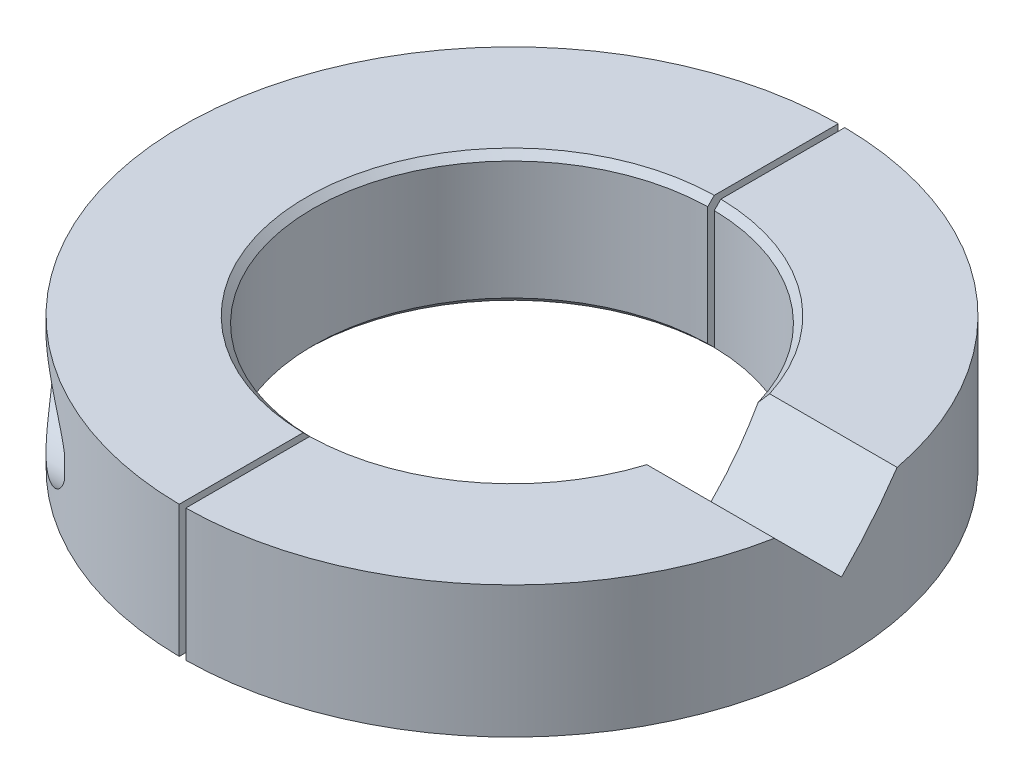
ISO-10303-21;
HEADER;
FILE_DESCRIPTION(('STEP AP214'),'2;1');
FILE_NAME('part.step','',(''),(''),'','','');
FILE_SCHEMA(('AUTOMOTIVE_DESIGN { 1 0 10303 214 1 1 1 1 }'));
ENDSEC;
DATA;
#1=APPLICATION_CONTEXT('core data for automotive mechanical design processes');
#2=APPLICATION_PROTOCOL_DEFINITION('international standard','automotive_design',2000,#1);
#3=PRODUCT_CONTEXT('',#1,'mechanical');
#4=PRODUCT('Part','Part','',(#3));
#5=PRODUCT_RELATED_PRODUCT_CATEGORY('part','',(#4));
#6=PRODUCT_DEFINITION_FORMATION('','',#4);
#7=PRODUCT_DEFINITION_CONTEXT('part definition',#1,'design');
#8=PRODUCT_DEFINITION('design','',#6,#7);
#9=PRODUCT_DEFINITION_SHAPE('','',#8);
#10=(LENGTH_UNIT() NAMED_UNIT(*) SI_UNIT(.MILLI.,.METRE.));
#11=(NAMED_UNIT(*) PLANE_ANGLE_UNIT() SI_UNIT($,.RADIAN.));
#12=(NAMED_UNIT(*) SI_UNIT($,.STERADIAN.) SOLID_ANGLE_UNIT());
#13=UNCERTAINTY_MEASURE_WITH_UNIT(LENGTH_MEASURE(1.E-05),#10,'distance_accuracy_value','');
#14=(GEOMETRIC_REPRESENTATION_CONTEXT(3) GLOBAL_UNCERTAINTY_ASSIGNED_CONTEXT((#13)) GLOBAL_UNIT_ASSIGNED_CONTEXT((#10,
#11,#12)) REPRESENTATION_CONTEXT('',''));
#15=CARTESIAN_POINT('',(0.,0.,0.));
#16=DIRECTION('',(0.,0.,1.));
#17=DIRECTION('',(1.,0.,0.));
#18=AXIS2_PLACEMENT_3D('',#15,#16,#17);
#19=CARTESIAN_POINT('',(0.,5.,0.));
#20=DIRECTION('',(0.,1.,0.));
#21=DIRECTION('',(0.,0.,1.));
#22=AXIS2_PLACEMENT_3D('',#19,#20,#21);
#23=PLANE('',#22);
#24=DIRECTION('',(0.,0.,-1.));
#25=VECTOR('',#24,1.);
#26=CARTESIAN_POINT('',(-0.249999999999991,5.,-36.6435199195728));
#27=LINE('',#26,#25);
#28=CARTESIAN_POINT('',(-0.249999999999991,5.,15.5979966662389));
#29=VERTEX_POINT('',#28);
#30=CARTESIAN_POINT('',(-0.249999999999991,5.,24.9987499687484));
#31=VERTEX_POINT('',#30);
#32=EDGE_CURVE('E132',#29,#31,#27,.F.);
#33=ORIENTED_EDGE('',*,*,#32,.F.);
#34=CARTESIAN_POINT('',(0.,5.,0.));
#35=DIRECTION('',(0.,1.,0.));
#36=DIRECTION('',(0.,0.,1.));
#37=AXIS2_PLACEMENT_3D('',#34,#35,#36);
#38=CIRCLE('',#37,15.6);
#39=CARTESIAN_POINT('',(-0.249999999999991,5.,-15.5979966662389));
#40=VERTEX_POINT('',#39);
#41=EDGE_CURVE('E13',#29,#40,#38,.F.);
#42=ORIENTED_EDGE('',*,*,#41,.T.);
#43=CARTESIAN_POINT('',(-0.249999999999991,5.,-24.9987499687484));
#44=VERTEX_POINT('',#43);
#45=EDGE_CURVE('E237',#44,#40,#27,.F.);
#46=ORIENTED_EDGE('',*,*,#45,.F.);
#47=CARTESIAN_POINT('',(0.,5.,0.));
#48=DIRECTION('',(0.,1.,0.));
#49=DIRECTION('',(0.,0.,1.));
#50=AXIS2_PLACEMENT_3D('',#47,#48,#49);
#51=CIRCLE('',#50,25.);
#52=EDGE_CURVE('E145',#44,#31,#51,.T.);
#53=ORIENTED_EDGE('',*,*,#52,.T.);
#54=EDGE_LOOP('',(#33,#42,#46,#53));
#55=FACE_BOUND('',#54,.T.);
#56=ADVANCED_FACE('F48',(#55),#23,.T.);
#57=CARTESIAN_POINT('',(0.,5.,0.));
#58=DIRECTION('',(0.,-1.,0.));
#59=DIRECTION('',(0.,0.,-1.));
#60=AXIS2_PLACEMENT_3D('',#57,#58,#59);
#61=CYLINDRICAL_SURFACE('',#60,25.);
#62=DIRECTION('',(0.,-1.,0.));
#63=VECTOR('',#62,1.);
#64=CARTESIAN_POINT('',(-12.,5.,21.9317121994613));
#65=LINE('',#64,#63);
#66=CARTESIAN_POINT('',(-12.,0.735961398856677,21.9317121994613));
#67=VERTEX_POINT('',#66);
#68=CARTESIAN_POINT('',(-12.,-0.735961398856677,21.9317121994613));
#69=VERTEX_POINT('',#68);
#70=EDGE_CURVE('E210',#67,#69,#65,.T.);
#71=ORIENTED_EDGE('',*,*,#70,.T.);
#72=CARTESIAN_POINT('',(-12.,-0.735961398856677,21.9317121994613));
#73=CARTESIAN_POINT('',(-12.0283083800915,-0.818707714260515,21.9162231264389));
#74=CARTESIAN_POINT('',(-12.060731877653,-0.899430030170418,21.8984113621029));
#75=CARTESIAN_POINT('',(-12.1323680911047,-1.05648581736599,21.8588042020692));
#76=CARTESIAN_POINT('',(-12.1715593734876,-1.1328321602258,21.8370213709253));
#77=CARTESIAN_POINT('',(-12.2962658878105,-1.35346526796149,21.7671942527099));
#78=CARTESIAN_POINT('',(-12.3897833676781,-1.49166650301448,21.7142024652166));
#79=CARTESIAN_POINT('',(-12.5702419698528,-1.72625326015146,21.610128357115));
#80=CARTESIAN_POINT('',(-12.6546995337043,-1.82544814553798,21.5608201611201));
#81=CARTESIAN_POINT('',(-12.8299642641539,-2.01517076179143,21.4569890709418));
#82=CARTESIAN_POINT('',(-12.9207736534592,-2.10569543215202,21.4024643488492));
#83=CARTESIAN_POINT('',(-13.1077432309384,-2.27965864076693,21.2884750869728));
#84=CARTESIAN_POINT('',(-13.2039436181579,-2.36302747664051,21.2289711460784));
#85=CARTESIAN_POINT('',(-13.3997213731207,-2.52254872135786,21.105943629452));
#86=CARTESIAN_POINT('',(-13.4992998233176,-2.59869878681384,21.0424187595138));
#87=CARTESIAN_POINT('',(-13.7723281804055,-2.79597420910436,20.8654024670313));
#88=CARTESIAN_POINT('',(-13.9481243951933,-2.91073372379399,20.7484010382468));
#89=CARTESIAN_POINT('',(-14.3037024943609,-3.12274791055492,20.5048931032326));
#90=CARTESIAN_POINT('',(-14.4834867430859,-3.21999186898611,20.3783808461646));
#91=CARTESIAN_POINT('',(-14.8447089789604,-3.39768543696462,20.1167662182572));
#92=CARTESIAN_POINT('',(-15.026144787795,-3.47815454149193,19.9816740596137));
#93=CARTESIAN_POINT('',(-15.3892718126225,-3.62258324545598,19.7033663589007));
#94=CARTESIAN_POINT('',(-15.5709629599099,-3.68654665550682,19.5601527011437));
#95=CARTESIAN_POINT('',(-15.9396067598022,-3.79950500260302,19.2610278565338));
#96=CARTESIAN_POINT('',(-16.1265247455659,-3.84790757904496,19.1048490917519));
#97=CARTESIAN_POINT('',(-16.4979985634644,-3.92566815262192,18.7849975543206));
#98=CARTESIAN_POINT('',(-16.6825538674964,-3.95502196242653,18.6213231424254));
#99=CARTESIAN_POINT('',(-17.0476057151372,-3.99316452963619,18.2877046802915));
#100=CARTESIAN_POINT('',(-17.2281084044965,-4.00198685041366,18.1177713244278));
#101=CARTESIAN_POINT('',(-17.583737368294,-3.99726513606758,17.7728318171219));
#102=CARTESIAN_POINT('',(-17.758866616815,-3.98373370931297,17.5978285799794));
#103=CARTESIAN_POINT('',(-18.1546593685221,-3.92415547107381,17.1904479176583));
#104=CARTESIAN_POINT('',(-18.3728972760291,-3.86944147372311,16.9568688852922));
#105=CARTESIAN_POINT('',(-18.7925142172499,-3.71241252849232,16.4905852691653));
#106=CARTESIAN_POINT('',(-18.9939164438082,-3.61016438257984,16.2578799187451));
#107=CARTESIAN_POINT('',(-19.3360434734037,-3.37855463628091,15.8484676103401));
#108=CARTESIAN_POINT('',(-19.4808573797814,-3.2586723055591,15.6698510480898));
#109=CARTESIAN_POINT('',(-19.7521196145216,-2.9833990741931,15.3264957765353));
#110=CARTESIAN_POINT('',(-19.8785878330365,-2.82804710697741,15.1617421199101));
#111=CARTESIAN_POINT('',(-20.0898923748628,-2.51083820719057,14.8802543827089));
#112=CARTESIAN_POINT('',(-20.17815454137,-2.3543560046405,14.7600906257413));
#113=CARTESIAN_POINT('',(-20.2969169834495,-2.10286578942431,14.5958813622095));
#114=CARTESIAN_POINT('',(-20.3342454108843,-2.01620150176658,14.5437992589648));
#115=CARTESIAN_POINT('',(-20.4040743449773,-1.83768651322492,14.4456695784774));
#116=CARTESIAN_POINT('',(-20.4365768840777,-1.74583801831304,14.3996194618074));
#117=CARTESIAN_POINT('',(-20.4966710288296,-1.55688314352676,14.3139525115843));
#118=CARTESIAN_POINT('',(-20.5242304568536,-1.4597473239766,14.2743779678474));
#119=CARTESIAN_POINT('',(-20.5739241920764,-1.26147306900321,14.2026598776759));
#120=CARTESIAN_POINT('',(-20.5960610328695,-1.16033652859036,14.1705128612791));
#121=CARTESIAN_POINT('',(-20.634710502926,-0.954831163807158,14.1141734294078));
#122=CARTESIAN_POINT('',(-20.6512237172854,-0.850462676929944,14.089980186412));
#123=CARTESIAN_POINT('',(-20.6784631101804,-0.639393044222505,14.0499733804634));
#124=CARTESIAN_POINT('',(-20.689189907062,-0.532692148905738,14.034158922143));
#125=CARTESIAN_POINT('',(-20.7039410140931,-0.329100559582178,14.0123865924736));
#126=CARTESIAN_POINT('',(-20.7085457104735,-0.232341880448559,14.0055756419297));
#127=CARTESIAN_POINT('',(-20.7129858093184,-0.0384411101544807,13.9990083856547));
#128=CARTESIAN_POINT('',(-20.7128196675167,0.0587010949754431,13.9992543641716));
#129=CARTESIAN_POINT('',(-20.707716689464,0.252519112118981,14.0068015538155));
#130=CARTESIAN_POINT('',(-20.702783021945,0.349195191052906,14.0140980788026));
#131=CARTESIAN_POINT('',(-20.688188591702,0.5414448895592,14.0356339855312));
#132=CARTESIAN_POINT('',(-20.6785260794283,0.637018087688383,14.0498759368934));
#133=CARTESIAN_POINT('',(-20.6549976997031,0.822793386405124,14.0844414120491));
#134=CARTESIAN_POINT('',(-20.641301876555,0.913062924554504,14.1045185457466));
#135=CARTESIAN_POINT('',(-20.6097049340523,1.09132100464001,14.1506480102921));
#136=CARTESIAN_POINT('',(-20.5918023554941,1.17930874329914,14.1767024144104));
#137=CARTESIAN_POINT('',(-20.5319741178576,1.43896149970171,14.2633445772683));
#138=CARTESIAN_POINT('',(-20.4839063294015,1.60648565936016,14.3324435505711));
#139=CARTESIAN_POINT('',(-20.3701223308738,1.93417949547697,14.4937313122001));
#140=CARTESIAN_POINT('',(-20.303679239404,2.09362711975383,14.5868572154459));
#141=CARTESIAN_POINT('',(-20.1560715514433,2.39368494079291,14.7901502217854));
#142=CARTESIAN_POINT('',(-20.0749019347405,2.53428868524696,14.9003231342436));
#143=CARTESIAN_POINT('',(-19.8891295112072,2.81108253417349,15.1475800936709));
#144=CARTESIAN_POINT('',(-19.7828804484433,2.9446876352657,15.2863072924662));
#145=CARTESIAN_POINT('',(-19.5567693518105,3.18630895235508,15.5745409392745));
#146=CARTESIAN_POINT('',(-19.4368981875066,3.29430785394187,15.7240545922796));
#147=CARTESIAN_POINT('',(-19.2178842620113,3.46118396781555,15.9904571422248));
#148=CARTESIAN_POINT('',(-19.1212055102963,3.52557108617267,16.105991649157));
#149=CARTESIAN_POINT('',(-18.9224413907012,3.64117806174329,16.339053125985));
#150=CARTESIAN_POINT('',(-18.820354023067,3.69239300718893,16.4565808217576));
#151=CARTESIAN_POINT('',(-18.6114406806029,3.78237721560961,16.6924877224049));
#152=CARTESIAN_POINT('',(-18.5046077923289,3.82112759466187,16.8108679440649));
#153=CARTESIAN_POINT('',(-18.2870168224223,3.88682981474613,17.0473121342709));
#154=CARTESIAN_POINT('',(-18.1762577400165,3.91377862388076,17.1653760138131));
#155=CARTESIAN_POINT('',(-17.9133530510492,3.9638544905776,17.4401582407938));
#156=CARTESIAN_POINT('',(-17.7598941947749,3.98259670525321,17.596426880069));
#157=CARTESIAN_POINT('',(-17.4483237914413,4.00187867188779,17.9054235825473));
#158=CARTESIAN_POINT('',(-17.2902106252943,4.00241201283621,18.0581503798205));
#159=CARTESIAN_POINT('',(-16.9702624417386,3.98669669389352,18.3591529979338));
#160=CARTESIAN_POINT('',(-16.8084228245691,3.97042607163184,18.5074227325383));
#161=CARTESIAN_POINT('',(-16.4822408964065,3.92226494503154,18.7984978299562));
#162=CARTESIAN_POINT('',(-16.3178988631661,3.89037616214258,18.9413037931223));
#163=CARTESIAN_POINT('',(-15.9836157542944,3.81093781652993,19.2242851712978));
#164=CARTESIAN_POINT('',(-15.8136356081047,3.76302685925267,19.3643125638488));
#165=CARTESIAN_POINT('',(-15.472990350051,3.65240881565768,19.6375724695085));
#166=CARTESIAN_POINT('',(-15.3023251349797,3.58969941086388,19.7708039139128));
#167=CARTESIAN_POINT('',(-14.9617716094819,3.44988551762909,20.0297544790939));
#168=CARTESIAN_POINT('',(-14.791882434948,3.37280909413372,20.1554876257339));
#169=CARTESIAN_POINT('',(-14.4538929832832,3.20401412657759,20.3992238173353));
#170=CARTESIAN_POINT('',(-14.2857920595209,3.11230108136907,20.5172297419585));
#171=CARTESIAN_POINT('',(-14.0213374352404,2.95424280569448,20.6982189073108));
#172=CARTESIAN_POINT('',(-13.9238251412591,2.89291373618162,20.7639246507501));
#173=CARTESIAN_POINT('',(-13.7305118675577,2.76461093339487,20.8922590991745));
#174=CARTESIAN_POINT('',(-13.6347106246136,2.69763807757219,20.9548882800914));
#175=CARTESIAN_POINT('',(-13.4452555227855,2.55754283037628,21.0769500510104));
#176=CARTESIAN_POINT('',(-13.3516057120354,2.48440988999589,21.136376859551));
#177=CARTESIAN_POINT('',(-13.1674580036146,2.33159996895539,21.251584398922));
#178=CARTESIAN_POINT('',(-13.0769595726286,2.25192410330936,21.3073657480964));
#179=CARTESIAN_POINT('',(-12.9172706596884,2.10143214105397,21.4044639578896));
#180=CARTESIAN_POINT('',(-12.8473382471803,2.03187319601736,21.4464949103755));
#181=CARTESIAN_POINT('',(-12.7110711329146,1.88767162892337,21.5275403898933));
#182=CARTESIAN_POINT('',(-12.6447376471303,1.81302730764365,21.5665538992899));
#183=CARTESIAN_POINT('',(-12.4533638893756,1.5816526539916,21.6779876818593));
#184=CARTESIAN_POINT('',(-12.3348953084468,1.41652501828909,21.7454379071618));
#185=CARTESIAN_POINT('',(-12.1861729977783,1.16039262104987,21.8288809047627));
#186=CARTESIAN_POINT('',(-12.1434538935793,1.07911961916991,21.8526548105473));
#187=CARTESIAN_POINT('',(-12.0655490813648,0.911358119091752,21.8957643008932));
#188=CARTESIAN_POINT('',(-12.0304074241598,0.824842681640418,21.9150739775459));
#189=CARTESIAN_POINT('',(-12.,0.735961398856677,21.9317121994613));
#190=B_SPLINE_CURVE_WITH_KNOTS('',3,(#72,#73,#74,#75,#76,#77,#78,#79,#80,#81,#82,#83,#84,#85,
#86,#87,#88,#89,#90,#91,#92,#93,#94,#95,#96,#97,#98,#99,#100,#101,#102,#103,#104,#105,#106,#107,
#108,#109,#110,#111,#112,#113,#114,#115,#116,#117,#118,#119,#120,#121,#122,#123,#124,#125,#126,
#127,#128,#129,#130,#131,#132,#133,#134,#135,#136,#137,#138,#139,#140,#141,#142,#143,#144,#145,
#146,#147,#148,#149,#150,#151,#152,#153,#154,#155,#156,#157,#158,#159,#160,#161,#162,#163,#164,
#165,#166,#167,#168,#169,#170,#171,#172,#173,#174,#175,#176,#177,#178,#179,#180,#181,#182,#183,
#184,#185,#186,#187,#188,#189),.UNSPECIFIED.,.F.,.F.,(4,2,2,2,2,2,2,2,2,2,2,2,2,2,2,2,2,2,2,2,2,
2,2,2,2,2,2,2,2,2,2,2,2,2,2,2,2,2,2,2,2,2,2,2,2,2,2,2,2,2,2,2,2,2,2,2,2,2,4),(0.,
0.266040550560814,0.53125350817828,1.05422978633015,1.47163031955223,1.889177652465,
2.31041547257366,2.73178957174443,3.45174482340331,4.17213896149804,4.89169116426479,
5.61107709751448,6.35527500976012,7.09963645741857,7.84278022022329,8.58550496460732,
9.55502881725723,10.5231942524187,11.2982016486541,12.0723624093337,12.7178256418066,
13.0408273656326,13.3636926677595,13.6885889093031,14.0133330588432,14.3380434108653,
14.6627190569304,14.9536757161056,15.2447265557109,15.5355840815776,15.8265492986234,
16.1066723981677,16.3868928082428,16.9468178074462,17.533212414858,18.1198072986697,
18.7772636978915,19.435163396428,19.9260316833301,20.4170827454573,20.9088742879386,
21.4007921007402,22.0592981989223,22.718036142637,23.3776361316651,24.0371634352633,
24.7127017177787,25.3883459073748,26.0626838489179,26.736769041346,27.1344792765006,
27.5321277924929,27.9304716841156,28.3287478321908,28.6501704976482,28.9717010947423,
29.6101155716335,29.8941719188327,30.1798375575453),.UNSPECIFIED.);
#191=EDGE_CURVE('E202',#69,#67,#190,.T.);
#192=ORIENTED_EDGE('',*,*,#191,.T.);
#193=EDGE_LOOP('',(#71,#192));
#194=FACE_BOUND('',#193,.T.);
#195=DIRECTION('',(0.,-1.,0.));
#196=VECTOR('',#195,1.);
#197=CARTESIAN_POINT('',(-12.,5.,-21.9317121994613));
#198=LINE('',#197,#196);
#199=CARTESIAN_POINT('',(-12.,-0.735961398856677,-21.9317121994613));
#200=VERTEX_POINT('',#199);
#201=CARTESIAN_POINT('',(-12.,0.735961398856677,-21.9317121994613));
#202=VERTEX_POINT('',#201);
#203=EDGE_CURVE('E209',#200,#202,#198,.F.);
#204=ORIENTED_EDGE('',*,*,#203,.T.);
#205=CARTESIAN_POINT('',(-12.,0.735961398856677,-21.9317121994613));
#206=CARTESIAN_POINT('',(-12.0283083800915,0.818707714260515,-21.9162231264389));
#207=CARTESIAN_POINT('',(-12.060731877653,0.899430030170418,-21.8984113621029));
#208=CARTESIAN_POINT('',(-12.1323680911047,1.05648581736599,-21.8588042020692));
#209=CARTESIAN_POINT('',(-12.1715593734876,1.1328321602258,-21.8370213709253));
#210=CARTESIAN_POINT('',(-12.2962658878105,1.35346526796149,-21.7671942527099));
#211=CARTESIAN_POINT('',(-12.3897833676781,1.49166650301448,-21.7142024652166));
#212=CARTESIAN_POINT('',(-12.5702419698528,1.72625326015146,-21.610128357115));
#213=CARTESIAN_POINT('',(-12.6546995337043,1.82544814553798,-21.5608201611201));
#214=CARTESIAN_POINT('',(-12.8299642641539,2.01517076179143,-21.4569890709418));
#215=CARTESIAN_POINT('',(-12.9207736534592,2.10569543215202,-21.4024643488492));
#216=CARTESIAN_POINT('',(-13.1077432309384,2.27965864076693,-21.2884750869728));
#217=CARTESIAN_POINT('',(-13.2039436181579,2.36302747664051,-21.2289711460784));
#218=CARTESIAN_POINT('',(-13.3997213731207,2.52254872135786,-21.105943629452));
#219=CARTESIAN_POINT('',(-13.4992998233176,2.59869878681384,-21.0424187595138));
#220=CARTESIAN_POINT('',(-13.7723281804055,2.79597420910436,-20.8654024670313));
#221=CARTESIAN_POINT('',(-13.9481243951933,2.91073372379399,-20.7484010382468));
#222=CARTESIAN_POINT('',(-14.3037024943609,3.12274791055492,-20.5048931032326));
#223=CARTESIAN_POINT('',(-14.4834867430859,3.21999186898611,-20.3783808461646));
#224=CARTESIAN_POINT('',(-14.8447089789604,3.39768543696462,-20.1167662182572));
#225=CARTESIAN_POINT('',(-15.026144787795,3.47815454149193,-19.9816740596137));
#226=CARTESIAN_POINT('',(-15.3892718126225,3.62258324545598,-19.7033663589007));
#227=CARTESIAN_POINT('',(-15.5709629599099,3.68654665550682,-19.5601527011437));
#228=CARTESIAN_POINT('',(-15.9396067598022,3.79950500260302,-19.2610278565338));
#229=CARTESIAN_POINT('',(-16.1265247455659,3.84790757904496,-19.1048490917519));
#230=CARTESIAN_POINT('',(-16.4979985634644,3.92566815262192,-18.7849975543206));
#231=CARTESIAN_POINT('',(-16.6825538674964,3.95502196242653,-18.6213231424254));
#232=CARTESIAN_POINT('',(-17.0476057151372,3.99316452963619,-18.2877046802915));
#233=CARTESIAN_POINT('',(-17.2281084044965,4.00198685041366,-18.1177713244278));
#234=CARTESIAN_POINT('',(-17.583737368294,3.99726513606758,-17.7728318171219));
#235=CARTESIAN_POINT('',(-17.758866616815,3.98373370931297,-17.5978285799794));
#236=CARTESIAN_POINT('',(-18.1546593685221,3.92415547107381,-17.1904479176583));
#237=CARTESIAN_POINT('',(-18.3728972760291,3.86944147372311,-16.9568688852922));
#238=CARTESIAN_POINT('',(-18.7925142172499,3.71241252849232,-16.4905852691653));
#239=CARTESIAN_POINT('',(-18.9939164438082,3.61016438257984,-16.2578799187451));
#240=CARTESIAN_POINT('',(-19.3360434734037,3.37855463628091,-15.8484676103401));
#241=CARTESIAN_POINT('',(-19.4808573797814,3.2586723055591,-15.6698510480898));
#242=CARTESIAN_POINT('',(-19.7521196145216,2.9833990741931,-15.3264957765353));
#243=CARTESIAN_POINT('',(-19.8785878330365,2.82804710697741,-15.1617421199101));
#244=CARTESIAN_POINT('',(-20.0898923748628,2.51083820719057,-14.8802543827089));
#245=CARTESIAN_POINT('',(-20.17815454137,2.3543560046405,-14.7600906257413));
#246=CARTESIAN_POINT('',(-20.2969169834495,2.10286578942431,-14.5958813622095));
#247=CARTESIAN_POINT('',(-20.3342454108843,2.01620150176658,-14.5437992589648));
#248=CARTESIAN_POINT('',(-20.4040743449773,1.83768651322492,-14.4456695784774));
#249=CARTESIAN_POINT('',(-20.4365768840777,1.74583801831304,-14.3996194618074));
#250=CARTESIAN_POINT('',(-20.4966710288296,1.55688314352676,-14.3139525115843));
#251=CARTESIAN_POINT('',(-20.5242304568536,1.4597473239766,-14.2743779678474));
#252=CARTESIAN_POINT('',(-20.5739241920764,1.26147306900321,-14.2026598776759));
#253=CARTESIAN_POINT('',(-20.5960610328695,1.16033652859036,-14.1705128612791));
#254=CARTESIAN_POINT('',(-20.634710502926,0.954831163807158,-14.1141734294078));
#255=CARTESIAN_POINT('',(-20.6512237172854,0.850462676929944,-14.089980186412));
#256=CARTESIAN_POINT('',(-20.6784631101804,0.639393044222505,-14.0499733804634));
#257=CARTESIAN_POINT('',(-20.689189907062,0.532692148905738,-14.034158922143));
#258=CARTESIAN_POINT('',(-20.7039410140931,0.329100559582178,-14.0123865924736));
#259=CARTESIAN_POINT('',(-20.7085457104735,0.232341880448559,-14.0055756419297));
#260=CARTESIAN_POINT('',(-20.7129858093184,0.0384411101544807,-13.9990083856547));
#261=CARTESIAN_POINT('',(-20.7128196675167,-0.0587010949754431,-13.9992543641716));
#262=CARTESIAN_POINT('',(-20.707716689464,-0.252519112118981,-14.0068015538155));
#263=CARTESIAN_POINT('',(-20.702783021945,-0.349195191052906,-14.0140980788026));
#264=CARTESIAN_POINT('',(-20.688188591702,-0.5414448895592,-14.0356339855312));
#265=CARTESIAN_POINT('',(-20.6785260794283,-0.637018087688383,-14.0498759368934));
#266=CARTESIAN_POINT('',(-20.6549976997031,-0.822793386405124,-14.0844414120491));
#267=CARTESIAN_POINT('',(-20.641301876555,-0.913062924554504,-14.1045185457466));
#268=CARTESIAN_POINT('',(-20.6097049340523,-1.09132100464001,-14.1506480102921));
#269=CARTESIAN_POINT('',(-20.5918023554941,-1.17930874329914,-14.1767024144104));
#270=CARTESIAN_POINT('',(-20.5319741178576,-1.43896149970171,-14.2633445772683));
#271=CARTESIAN_POINT('',(-20.4839063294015,-1.60648565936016,-14.3324435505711));
#272=CARTESIAN_POINT('',(-20.3701223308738,-1.93417949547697,-14.4937313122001));
#273=CARTESIAN_POINT('',(-20.303679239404,-2.09362711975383,-14.5868572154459));
#274=CARTESIAN_POINT('',(-20.1560715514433,-2.39368494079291,-14.7901502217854));
#275=CARTESIAN_POINT('',(-20.0749019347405,-2.53428868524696,-14.9003231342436));
#276=CARTESIAN_POINT('',(-19.8891295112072,-2.81108253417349,-15.1475800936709));
#277=CARTESIAN_POINT('',(-19.7828804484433,-2.9446876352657,-15.2863072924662));
#278=CARTESIAN_POINT('',(-19.5567693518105,-3.18630895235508,-15.5745409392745));
#279=CARTESIAN_POINT('',(-19.4368981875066,-3.29430785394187,-15.7240545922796));
#280=CARTESIAN_POINT('',(-19.2178842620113,-3.46118396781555,-15.9904571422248));
#281=CARTESIAN_POINT('',(-19.1212055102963,-3.52557108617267,-16.105991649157));
#282=CARTESIAN_POINT('',(-18.9224413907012,-3.64117806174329,-16.339053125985));
#283=CARTESIAN_POINT('',(-18.820354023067,-3.69239300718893,-16.4565808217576));
#284=CARTESIAN_POINT('',(-18.6114406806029,-3.78237721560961,-16.6924877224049));
#285=CARTESIAN_POINT('',(-18.5046077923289,-3.82112759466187,-16.8108679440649));
#286=CARTESIAN_POINT('',(-18.2870168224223,-3.88682981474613,-17.0473121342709));
#287=CARTESIAN_POINT('',(-18.1762577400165,-3.91377862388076,-17.1653760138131));
#288=CARTESIAN_POINT('',(-17.9133530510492,-3.9638544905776,-17.4401582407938));
#289=CARTESIAN_POINT('',(-17.7598941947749,-3.98259670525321,-17.596426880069));
#290=CARTESIAN_POINT('',(-17.4483237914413,-4.00187867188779,-17.9054235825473));
#291=CARTESIAN_POINT('',(-17.2902106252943,-4.00241201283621,-18.0581503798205));
#292=CARTESIAN_POINT('',(-16.9702624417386,-3.98669669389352,-18.3591529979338));
#293=CARTESIAN_POINT('',(-16.8084228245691,-3.97042607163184,-18.5074227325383));
#294=CARTESIAN_POINT('',(-16.4822408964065,-3.92226494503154,-18.7984978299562));
#295=CARTESIAN_POINT('',(-16.3178988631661,-3.89037616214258,-18.9413037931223));
#296=CARTESIAN_POINT('',(-15.9836157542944,-3.81093781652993,-19.2242851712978));
#297=CARTESIAN_POINT('',(-15.8136356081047,-3.76302685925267,-19.3643125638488));
#298=CARTESIAN_POINT('',(-15.472990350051,-3.65240881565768,-19.6375724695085));
#299=CARTESIAN_POINT('',(-15.3023251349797,-3.58969941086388,-19.7708039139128));
#300=CARTESIAN_POINT('',(-14.9617716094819,-3.44988551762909,-20.0297544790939));
#301=CARTESIAN_POINT('',(-14.791882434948,-3.37280909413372,-20.1554876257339));
#302=CARTESIAN_POINT('',(-14.4538929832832,-3.20401412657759,-20.3992238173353));
#303=CARTESIAN_POINT('',(-14.2857920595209,-3.11230108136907,-20.5172297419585));
#304=CARTESIAN_POINT('',(-14.0213374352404,-2.95424280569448,-20.6982189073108));
#305=CARTESIAN_POINT('',(-13.9238251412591,-2.89291373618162,-20.7639246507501));
#306=CARTESIAN_POINT('',(-13.7305118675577,-2.76461093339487,-20.8922590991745));
#307=CARTESIAN_POINT('',(-13.6347106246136,-2.69763807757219,-20.9548882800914));
#308=CARTESIAN_POINT('',(-13.4452555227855,-2.55754283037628,-21.0769500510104));
#309=CARTESIAN_POINT('',(-13.3516057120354,-2.48440988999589,-21.136376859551));
#310=CARTESIAN_POINT('',(-13.1674580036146,-2.33159996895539,-21.251584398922));
#311=CARTESIAN_POINT('',(-13.0769595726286,-2.25192410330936,-21.3073657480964));
#312=CARTESIAN_POINT('',(-12.9172706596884,-2.10143214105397,-21.4044639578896));
#313=CARTESIAN_POINT('',(-12.8473382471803,-2.03187319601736,-21.4464949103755));
#314=CARTESIAN_POINT('',(-12.7110711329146,-1.88767162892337,-21.5275403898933));
#315=CARTESIAN_POINT('',(-12.6447376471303,-1.81302730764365,-21.5665538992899));
#316=CARTESIAN_POINT('',(-12.4533638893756,-1.5816526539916,-21.6779876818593));
#317=CARTESIAN_POINT('',(-12.3348953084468,-1.41652501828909,-21.7454379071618));
#318=CARTESIAN_POINT('',(-12.1861729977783,-1.16039262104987,-21.8288809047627));
#319=CARTESIAN_POINT('',(-12.1434538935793,-1.07911961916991,-21.8526548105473));
#320=CARTESIAN_POINT('',(-12.0655490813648,-0.911358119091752,-21.8957643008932));
#321=CARTESIAN_POINT('',(-12.0304074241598,-0.824842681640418,-21.9150739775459));
#322=CARTESIAN_POINT('',(-12.,-0.735961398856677,-21.9317121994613));
#323=B_SPLINE_CURVE_WITH_KNOTS('',3,(#205,#206,#207,#208,#209,#210,#211,#212,#213,#214,#215,
#216,#217,#218,#219,#220,#221,#222,#223,#224,#225,#226,#227,#228,#229,#230,#231,#232,#233,#234,
#235,#236,#237,#238,#239,#240,#241,#242,#243,#244,#245,#246,#247,#248,#249,#250,#251,#252,#253,
#254,#255,#256,#257,#258,#259,#260,#261,#262,#263,#264,#265,#266,#267,#268,#269,#270,#271,#272,
#273,#274,#275,#276,#277,#278,#279,#280,#281,#282,#283,#284,#285,#286,#287,#288,#289,#290,#291,
#292,#293,#294,#295,#296,#297,#298,#299,#300,#301,#302,#303,#304,#305,#306,#307,#308,#309,#310,
#311,#312,#313,#314,#315,#316,#317,#318,#319,#320,#321,#322),.UNSPECIFIED.,.F.,.F.,(4,2,2,2,2,2,
2,2,2,2,2,2,2,2,2,2,2,2,2,2,2,2,2,2,2,2,2,2,2,2,2,2,2,2,2,2,2,2,2,2,2,2,2,2,2,2,2,2,2,2,2,2,2,2,
2,2,2,2,4),(0.,0.266040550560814,0.53125350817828,1.05422978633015,1.47163031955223,
1.889177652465,2.31041547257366,2.73178957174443,3.45174482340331,4.17213896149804,
4.89169116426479,5.61107709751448,6.35527500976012,7.09963645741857,7.84278022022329,
8.58550496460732,9.55502881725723,10.5231942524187,11.2982016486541,12.0723624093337,
12.7178256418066,13.0408273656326,13.3636926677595,13.6885889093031,14.0133330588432,
14.3380434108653,14.6627190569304,14.9536757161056,15.2447265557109,15.5355840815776,
15.8265492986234,16.1066723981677,16.3868928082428,16.9468178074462,17.533212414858,
18.1198072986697,18.7772636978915,19.435163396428,19.9260316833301,20.4170827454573,
20.9088742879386,21.4007921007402,22.0592981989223,22.718036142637,23.3776361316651,
24.0371634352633,24.7127017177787,25.3883459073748,26.0626838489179,26.736769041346,
27.1344792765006,27.5321277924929,27.9304716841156,28.3287478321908,28.6501704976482,
28.9717010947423,29.6101155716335,29.8941719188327,30.1798375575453),.UNSPECIFIED.);
#324=EDGE_CURVE('E141',#202,#200,#323,.T.);
#325=ORIENTED_EDGE('',*,*,#324,.T.);
#326=EDGE_LOOP('',(#204,#325));
#327=FACE_BOUND('',#326,.T.);
#328=ORIENTED_EDGE('',*,*,#52,.F.);
#329=DIRECTION('',(0.,-1.,0.));
#330=VECTOR('',#329,1.);
#331=CARTESIAN_POINT('',(-0.249999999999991,5.,-24.9987499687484));
#332=LINE('',#331,#330);
#333=CARTESIAN_POINT('',(-0.249999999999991,-5.,-24.9987499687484));
#334=VERTEX_POINT('',#333);
#335=EDGE_CURVE('E139',#44,#334,#332,.T.);
#336=ORIENTED_EDGE('',*,*,#335,.T.);
#337=CARTESIAN_POINT('',(0.,-5.,0.));
#338=DIRECTION('',(0.,1.,0.));
#339=DIRECTION('',(0.,0.,1.));
#340=AXIS2_PLACEMENT_3D('',#337,#338,#339);
#341=CIRCLE('',#340,25.);
#342=CARTESIAN_POINT('',(-0.249999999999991,-5.,24.9987499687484));
#343=VERTEX_POINT('',#342);
#344=EDGE_CURVE('E122',#334,#343,#341,.T.);
#345=ORIENTED_EDGE('',*,*,#344,.T.);
#346=DIRECTION('',(0.,-1.,0.));
#347=VECTOR('',#346,1.);
#348=CARTESIAN_POINT('',(-0.249999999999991,5.,24.9987499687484));
#349=LINE('',#348,#347);
#350=EDGE_CURVE('E130',#343,#31,#349,.F.);
#351=ORIENTED_EDGE('',*,*,#350,.T.);
#352=EDGE_LOOP('',(#328,#336,#345,#351));
#353=FACE_BOUND('',#352,.T.);
#354=ADVANCED_FACE('F138',(#194,#327,#353),#61,.T.);
#355=CARTESIAN_POINT('',(0.,5.,0.));
#356=DIRECTION('',(0.,-1.,0.));
#357=DIRECTION('',(0.,0.,-1.));
#358=AXIS2_PLACEMENT_3D('',#355,#356,#357);
#359=CYLINDRICAL_SURFACE('',#358,15.1);
#360=DIRECTION('',(0.,-1.,0.));
#361=VECTOR('',#360,1.);
#362=CARTESIAN_POINT('',(-0.249999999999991,5.,15.0979303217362));
#363=LINE('',#362,#361);
#364=CARTESIAN_POINT('',(-0.249999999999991,-4.5,15.0979303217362));
#365=VERTEX_POINT('',#364);
#366=CARTESIAN_POINT('',(-0.249999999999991,4.5,15.0979303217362));
#367=VERTEX_POINT('',#366);
#368=EDGE_CURVE('E241',#365,#367,#363,.F.);
#369=ORIENTED_EDGE('',*,*,#368,.F.);
#370=CARTESIAN_POINT('',(0.,-4.5,0.));
#371=DIRECTION('',(0.,1.,0.));
#372=DIRECTION('',(0.,0.,1.));
#373=AXIS2_PLACEMENT_3D('',#370,#371,#372);
#374=CIRCLE('',#373,15.1);
#375=CARTESIAN_POINT('',(-0.249999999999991,-4.5,-15.0979303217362));
#376=VERTEX_POINT('',#375);
#377=EDGE_CURVE('E70',#365,#376,#374,.F.);
#378=ORIENTED_EDGE('',*,*,#377,.T.);
#379=DIRECTION('',(0.,-1.,0.));
#380=VECTOR('',#379,1.);
#381=CARTESIAN_POINT('',(-0.249999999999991,5.,-15.0979303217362));
#382=LINE('',#381,#380);
#383=CARTESIAN_POINT('',(-0.249999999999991,4.5,-15.0979303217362));
#384=VERTEX_POINT('',#383);
#385=EDGE_CURVE('E149',#384,#376,#382,.T.);
#386=ORIENTED_EDGE('',*,*,#385,.F.);
#387=CARTESIAN_POINT('',(0.,4.5,0.));
#388=DIRECTION('',(0.,1.,0.));
#389=DIRECTION('',(0.,0.,1.));
#390=AXIS2_PLACEMENT_3D('',#387,#388,#389);
#391=CIRCLE('',#390,15.1);
#392=EDGE_CURVE('E279',#384,#367,#391,.T.);
#393=ORIENTED_EDGE('',*,*,#392,.T.);
#394=EDGE_LOOP('',(#369,#378,#386,#393));
#395=FACE_BOUND('',#394,.T.);
#396=ADVANCED_FACE('F191',(#395),#359,.F.);
#397=CARTESIAN_POINT('',(0.,-5.,0.));
#398=DIRECTION('',(0.,1.,0.));
#399=DIRECTION('',(0.,0.,1.));
#400=AXIS2_PLACEMENT_3D('',#397,#398,#399);
#401=PLANE('',#400);
#402=DIRECTION('',(0.,0.,-1.));
#403=VECTOR('',#402,1.);
#404=CARTESIAN_POINT('',(-0.249999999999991,-5.,-36.6435199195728));
#405=LINE('',#404,#403);
#406=CARTESIAN_POINT('',(-0.249999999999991,-5.,-15.5979966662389));
#407=VERTEX_POINT('',#406);
#408=EDGE_CURVE('E127',#334,#407,#405,.F.);
#409=ORIENTED_EDGE('',*,*,#408,.T.);
#410=CARTESIAN_POINT('',(0.,-5.,0.));
#411=DIRECTION('',(0.,1.,0.));
#412=DIRECTION('',(0.,0.,1.));
#413=AXIS2_PLACEMENT_3D('',#410,#411,#412);
#414=CIRCLE('',#413,15.6);
#415=CARTESIAN_POINT('',(-0.249999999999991,-5.,15.5979966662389));
#416=VERTEX_POINT('',#415);
#417=EDGE_CURVE('E124',#407,#416,#414,.T.);
#418=ORIENTED_EDGE('',*,*,#417,.T.);
#419=EDGE_CURVE('E117',#416,#343,#405,.F.);
#420=ORIENTED_EDGE('',*,*,#419,.T.);
#421=ORIENTED_EDGE('',*,*,#344,.F.);
#422=EDGE_LOOP('',(#409,#418,#420,#421));
#423=FACE_BOUND('',#422,.T.);
#424=ADVANCED_FACE('F120',(#423),#401,.F.);
#425=CARTESIAN_POINT('',(-39.8672165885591,0.,-18.));
#426=DIRECTION('',(-1.,0.,0.));
#427=DIRECTION('',(0.,0.,1.));
#428=AXIS2_PLACEMENT_3D('',#425,#426,#427);
#429=CYLINDRICAL_SURFACE('',#428,4.);
#430=CARTESIAN_POINT('',(-12.,0.,-18.));
#431=DIRECTION('',(-1.,0.,0.));
#432=DIRECTION('',(0.,0.,1.));
#433=AXIS2_PLACEMENT_3D('',#430,#431,#432);
#434=CIRCLE('',#433,4.);
#435=EDGE_CURVE('E126',#200,#202,#434,.T.);
#436=ORIENTED_EDGE('',*,*,#435,.F.);
#437=ORIENTED_EDGE('',*,*,#324,.F.);
#438=EDGE_LOOP('',(#436,#437));
#439=FACE_BOUND('',#438,.T.);
#440=ADVANCED_FACE('F256',(#439),#429,.F.);
#441=CARTESIAN_POINT('',(-12.,0.,-14.));
#442=DIRECTION('',(1.,0.,0.));
#443=DIRECTION('',(0.,0.,-1.));
#444=AXIS2_PLACEMENT_3D('',#441,#442,#443);
#445=PLANE('',#444);
#446=CARTESIAN_POINT('',(-12.,0.,-18.));
#447=DIRECTION('',(-1.,0.,0.));
#448=DIRECTION('',(0.,0.,1.));
#449=AXIS2_PLACEMENT_3D('',#446,#447,#448);
#450=CIRCLE('',#449,2.1);
#451=CARTESIAN_POINT('',(-12.,0.,-15.9));
#452=VERTEX_POINT('',#451);
#453=EDGE_CURVE('E234',#452,#452,#450,.T.);
#454=ORIENTED_EDGE('',*,*,#453,.F.);
#455=EDGE_LOOP('',(#454));
#456=FACE_BOUND('',#455,.T.);
#457=ORIENTED_EDGE('',*,*,#435,.T.);
#458=ORIENTED_EDGE('',*,*,#203,.F.);
#459=EDGE_LOOP('',(#457,#458));
#460=FACE_BOUND('',#459,.T.);
#461=ADVANCED_FACE('F258',(#456,#460),#445,.F.);
#462=CARTESIAN_POINT('',(-39.8672165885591,0.,-18.));
#463=DIRECTION('',(-1.,0.,0.));
#464=DIRECTION('',(0.,0.,1.));
#465=AXIS2_PLACEMENT_3D('',#462,#463,#464);
#466=CYLINDRICAL_SURFACE('',#465,2.1);
#467=CARTESIAN_POINT('',(-0.249999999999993,0.,-18.));
#468=DIRECTION('',(-1.,0.,0.));
#469=DIRECTION('',(0.,0.,1.));
#470=AXIS2_PLACEMENT_3D('',#467,#468,#469);
#471=CIRCLE('',#470,2.1);
#472=CARTESIAN_POINT('',(-0.249999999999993,0.,-15.9));
#473=VERTEX_POINT('',#472);
#474=EDGE_CURVE('E243',#473,#473,#471,.F.);
#475=ORIENTED_EDGE('',*,*,#474,.T.);
#476=EDGE_LOOP('',(#475));
#477=FACE_BOUND('',#476,.T.);
#478=ORIENTED_EDGE('',*,*,#453,.T.);
#479=EDGE_LOOP('',(#478));
#480=FACE_BOUND('',#479,.T.);
#481=ADVANCED_FACE('F217',(#477,#480),#466,.F.);
#482=CARTESIAN_POINT('',(-39.8672165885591,0.,18.));
#483=DIRECTION('',(-1.,0.,0.));
#484=DIRECTION('',(0.,0.,-1.));
#485=AXIS2_PLACEMENT_3D('',#482,#483,#484);
#486=CYLINDRICAL_SURFACE('',#485,4.);
#487=CARTESIAN_POINT('',(-12.,0.,18.));
#488=DIRECTION('',(1.,0.,0.));
#489=DIRECTION('',(0.,0.,-1.));
#490=AXIS2_PLACEMENT_3D('',#487,#488,#489);
#491=CIRCLE('',#490,4.);
#492=EDGE_CURVE('E231',#69,#67,#491,.T.);
#493=ORIENTED_EDGE('',*,*,#492,.T.);
#494=ORIENTED_EDGE('',*,*,#191,.F.);
#495=EDGE_LOOP('',(#493,#494));
#496=FACE_BOUND('',#495,.T.);
#497=ADVANCED_FACE('F212',(#496),#486,.F.);
#498=CARTESIAN_POINT('',(-12.,0.,14.));
#499=DIRECTION('',(1.,0.,0.));
#500=DIRECTION('',(0.,0.,1.));
#501=AXIS2_PLACEMENT_3D('',#498,#499,#500);
#502=PLANE('',#501);
#503=CARTESIAN_POINT('',(-12.,0.,18.));
#504=DIRECTION('',(1.,0.,0.));
#505=DIRECTION('',(0.,0.,-1.));
#506=AXIS2_PLACEMENT_3D('',#503,#504,#505);
#507=CIRCLE('',#506,2.1);
#508=CARTESIAN_POINT('',(-12.,0.,15.9));
#509=VERTEX_POINT('',#508);
#510=EDGE_CURVE('E229',#509,#509,#507,.T.);
#511=ORIENTED_EDGE('',*,*,#510,.T.);
#512=EDGE_LOOP('',(#511));
#513=FACE_BOUND('',#512,.T.);
#514=ORIENTED_EDGE('',*,*,#492,.F.);
#515=ORIENTED_EDGE('',*,*,#70,.F.);
#516=EDGE_LOOP('',(#514,#515));
#517=FACE_BOUND('',#516,.T.);
#518=ADVANCED_FACE('F216',(#513,#517),#502,.F.);
#519=CARTESIAN_POINT('',(-39.8672165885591,0.,18.));
#520=DIRECTION('',(-1.,0.,0.));
#521=DIRECTION('',(0.,0.,-1.));
#522=AXIS2_PLACEMENT_3D('',#519,#520,#521);
#523=CYLINDRICAL_SURFACE('',#522,2.1);
#524=CARTESIAN_POINT('',(-0.249999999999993,0.,18.));
#525=DIRECTION('',(-1.,0.,0.));
#526=DIRECTION('',(0.,0.,1.));
#527=AXIS2_PLACEMENT_3D('',#524,#525,#526);
#528=CIRCLE('',#527,2.1);
#529=CARTESIAN_POINT('',(-0.249999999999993,0.,20.1));
#530=VERTEX_POINT('',#529);
#531=EDGE_CURVE('E211',#530,#530,#528,.F.);
#532=ORIENTED_EDGE('',*,*,#531,.T.);
#533=EDGE_LOOP('',(#532));
#534=FACE_BOUND('',#533,.T.);
#535=ORIENTED_EDGE('',*,*,#510,.F.);
#536=EDGE_LOOP('',(#535));
#537=FACE_BOUND('',#536,.T.);
#538=ADVANCED_FACE('F167',(#534,#537),#523,.F.);
#539=CARTESIAN_POINT('',(-0.249999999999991,-5.,-36.6435199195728));
#540=DIRECTION('',(-1.,0.,0.));
#541=DIRECTION('',(0.,0.,1.));
#542=AXIS2_PLACEMENT_3D('',#539,#540,#541);
#543=PLANE('',#542);
#544=ORIENTED_EDGE('',*,*,#531,.F.);
#545=EDGE_LOOP('',(#544));
#546=FACE_BOUND('',#545,.T.);
#547=ORIENTED_EDGE('',*,*,#419,.F.);
#548=CARTESIAN_POINT('',(-0.249999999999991,-5.,15.5979966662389));
#549=CARTESIAN_POINT('',(-0.249999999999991,-4.9166664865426,15.5146524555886));
#550=CARTESIAN_POINT('',(-0.249999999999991,-4.83333306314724,15.4313081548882));
#551=CARTESIAN_POINT('',(-0.249999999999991,-4.66666639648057,15.2646193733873));
#552=CARTESIAN_POINT('',(-0.249999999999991,-4.58333315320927,15.1812748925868));
#553=CARTESIAN_POINT('',(-0.249999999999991,-4.5,15.0979303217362));
#554=B_SPLINE_CURVE_WITH_KNOTS('',3,(#548,#549,#550,#551,#552,#553),.UNSPECIFIED.,.F.,.F.,(4,2,
4),(0.,0.353576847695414,0.707153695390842),.UNSPECIFIED.);
#555=EDGE_CURVE('E155',#416,#365,#554,.T.);
#556=ORIENTED_EDGE('',*,*,#555,.T.);
#557=ORIENTED_EDGE('',*,*,#368,.T.);
#558=CARTESIAN_POINT('',(-0.249999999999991,4.5,15.0979303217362));
#559=CARTESIAN_POINT('',(-0.249999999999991,4.58333315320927,15.1812748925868));
#560=CARTESIAN_POINT('',(-0.249999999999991,4.66666639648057,15.2646193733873));
#561=CARTESIAN_POINT('',(-0.249999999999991,4.83333306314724,15.4313081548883));
#562=CARTESIAN_POINT('',(-0.249999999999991,4.9166664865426,15.5146524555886));
#563=CARTESIAN_POINT('',(-0.249999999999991,5.,15.5979966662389));
#564=B_SPLINE_CURVE_WITH_KNOTS('',3,(#558,#559,#560,#561,#562,#563),.UNSPECIFIED.,.F.,.F.,(4,2,
4),(0.,0.353576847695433,0.707153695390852),.UNSPECIFIED.);
#565=EDGE_CURVE('E148',#367,#29,#564,.T.);
#566=ORIENTED_EDGE('',*,*,#565,.T.);
#567=ORIENTED_EDGE('',*,*,#32,.T.);
#568=ORIENTED_EDGE('',*,*,#350,.F.);
#569=EDGE_LOOP('',(#547,#556,#557,#566,#567,#568));
#570=FACE_BOUND('',#569,.T.);
#571=ADVANCED_FACE('F131',(#546,#570),#543,.F.);
#572=ORIENTED_EDGE('',*,*,#474,.F.);
#573=EDGE_LOOP('',(#572));
#574=FACE_BOUND('',#573,.T.);
#575=ORIENTED_EDGE('',*,*,#385,.T.);
#576=CARTESIAN_POINT('',(-0.249999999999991,-4.5,-15.0979303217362));
#577=CARTESIAN_POINT('',(-0.249999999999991,-4.58333315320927,-15.1812748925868));
#578=CARTESIAN_POINT('',(-0.249999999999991,-4.66666639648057,-15.2646193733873));
#579=CARTESIAN_POINT('',(-0.249999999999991,-4.83333306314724,-15.4313081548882));
#580=CARTESIAN_POINT('',(-0.249999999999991,-4.9166664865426,-15.5146524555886));
#581=CARTESIAN_POINT('',(-0.249999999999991,-5.,-15.5979966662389));
#582=B_SPLINE_CURVE_WITH_KNOTS('',3,(#576,#577,#578,#579,#580,#581),.UNSPECIFIED.,.F.,.F.,(4,2,
4),(0.,0.353576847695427,0.707153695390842),.UNSPECIFIED.);
#583=EDGE_CURVE('E57',#376,#407,#582,.T.);
#584=ORIENTED_EDGE('',*,*,#583,.T.);
#585=ORIENTED_EDGE('',*,*,#408,.F.);
#586=ORIENTED_EDGE('',*,*,#335,.F.);
#587=ORIENTED_EDGE('',*,*,#45,.T.);
#588=CARTESIAN_POINT('',(-0.249999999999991,5.,-15.5979966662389));
#589=CARTESIAN_POINT('',(-0.249999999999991,4.9166664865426,-15.5146524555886));
#590=CARTESIAN_POINT('',(-0.249999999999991,4.83333306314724,-15.4313081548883));
#591=CARTESIAN_POINT('',(-0.249999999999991,4.66666639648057,-15.2646193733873));
#592=CARTESIAN_POINT('',(-0.249999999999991,4.58333315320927,-15.1812748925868));
#593=CARTESIAN_POINT('',(-0.249999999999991,4.5,-15.0979303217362));
#594=B_SPLINE_CURVE_WITH_KNOTS('',3,(#588,#589,#590,#591,#592,#593),.UNSPECIFIED.,.F.,.F.,(4,2,
4),(0.,0.353576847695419,0.707153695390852),.UNSPECIFIED.);
#595=EDGE_CURVE('E174',#40,#384,#594,.T.);
#596=ORIENTED_EDGE('',*,*,#595,.T.);
#597=EDGE_LOOP('',(#575,#584,#585,#586,#587,#596));
#598=FACE_BOUND('',#597,.T.);
#599=ADVANCED_FACE('F160',(#574,#598),#543,.F.);
#600=CARTESIAN_POINT('',(0.,-5.,0.));
#601=DIRECTION('',(0.,-1.,0.));
#602=DIRECTION('',(0.,0.,-1.));
#603=AXIS2_PLACEMENT_3D('',#600,#601,#602);
#604=CONICAL_SURFACE('',#603,15.6,0.785398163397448);
#605=ORIENTED_EDGE('',*,*,#583,.F.);
#606=ORIENTED_EDGE('',*,*,#377,.F.);
#607=ORIENTED_EDGE('',*,*,#555,.F.);
#608=ORIENTED_EDGE('',*,*,#417,.F.);
#609=EDGE_LOOP('',(#605,#606,#607,#608));
#610=FACE_BOUND('',#609,.T.);
#611=ADVANCED_FACE('F165',(#610),#604,.F.);
#612=CARTESIAN_POINT('',(0.,4.5,0.));
#613=DIRECTION('',(0.,1.,0.));
#614=DIRECTION('',(0.,0.,1.));
#615=AXIS2_PLACEMENT_3D('',#612,#613,#614);
#616=CONICAL_SURFACE('',#615,15.1,0.785398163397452);
#617=ORIENTED_EDGE('',*,*,#595,.F.);
#618=ORIENTED_EDGE('',*,*,#41,.F.);
#619=ORIENTED_EDGE('',*,*,#565,.F.);
#620=ORIENTED_EDGE('',*,*,#392,.F.);
#621=EDGE_LOOP('',(#617,#618,#619,#620));
#622=FACE_BOUND('',#621,.T.);
#623=ADVANCED_FACE('F50',(#622),#616,.F.);
#624=CLOSED_SHELL('',(#56,#354,#396,#424,#440,#461,#481,#497,#518,#538,#571,#599,#611,#623));
#625=MANIFOLD_SOLID_BREP('B2',#624);
#626=CARTESIAN_POINT('',(12.,0.,18.));
#627=DIRECTION('',(-1.,0.,0.));
#628=DIRECTION('',(0.,0.,1.));
#629=AXIS2_PLACEMENT_3D('',#626,#627,#628);
#630=CONICAL_SURFACE('',#629,1.65,1.02974425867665);
#631=CARTESIAN_POINT('',(12.9914200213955,0.,18.));
#632=VERTEX_POINT('',#631);
#633=VERTEX_LOOP('',#632);
#634=FACE_BOUND('',#633,.T.);
#635=CARTESIAN_POINT('',(12.,0.,18.));
#636=DIRECTION('',(-1.,0.,0.));
#637=DIRECTION('',(0.,0.,1.));
#638=AXIS2_PLACEMENT_3D('',#635,#636,#637);
#639=CIRCLE('',#638,1.65);
#640=CARTESIAN_POINT('',(12.,0.,19.65));
#641=VERTEX_POINT('',#640);
#642=EDGE_CURVE('E446',#641,#641,#639,.T.);
#643=ORIENTED_EDGE('',*,*,#642,.T.);
#644=EDGE_LOOP('',(#643));
#645=FACE_BOUND('',#644,.T.);
#646=ADVANCED_FACE('F338',(#634,#645),#630,.F.);
#647=CARTESIAN_POINT('',(0.,0.,18.));
#648=DIRECTION('',(-1.,0.,0.));
#649=DIRECTION('',(0.,0.,1.));
#650=AXIS2_PLACEMENT_3D('',#647,#648,#649);
#651=CYLINDRICAL_SURFACE('',#650,1.65);
#652=ORIENTED_EDGE('',*,*,#642,.F.);
#653=EDGE_LOOP('',(#652));
#654=FACE_BOUND('',#653,.T.);
#655=CARTESIAN_POINT('',(0.250000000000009,0.,18.));
#656=DIRECTION('',(-1.,0.,0.));
#657=DIRECTION('',(0.,0.,1.));
#658=AXIS2_PLACEMENT_3D('',#655,#656,#657);
#659=CIRCLE('',#658,1.65);
#660=CARTESIAN_POINT('',(0.250000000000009,0.,19.65));
#661=VERTEX_POINT('',#660);
#662=EDGE_CURVE('E464',#661,#661,#659,.F.);
#663=ORIENTED_EDGE('',*,*,#662,.F.);
#664=EDGE_LOOP('',(#663));
#665=FACE_BOUND('',#664,.T.);
#666=ADVANCED_FACE('F488',(#654,#665),#651,.F.);
#667=CARTESIAN_POINT('',(0.250000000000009,-5.,-36.6435199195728));
#668=DIRECTION('',(-1.,0.,0.));
#669=DIRECTION('',(0.,0.,1.));
#670=AXIS2_PLACEMENT_3D('',#667,#668,#669);
#671=PLANE('',#670);
#672=ORIENTED_EDGE('',*,*,#662,.T.);
#673=EDGE_LOOP('',(#672));
#674=FACE_BOUND('',#673,.T.);
#675=DIRECTION('',(0.,-1.,0.));
#676=VECTOR('',#675,1.);
#677=CARTESIAN_POINT('',(0.250000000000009,5.,15.0979303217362));
#678=LINE('',#677,#676);
#679=CARTESIAN_POINT('',(0.250000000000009,-4.5,15.0979303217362));
#680=VERTEX_POINT('',#679);
#681=CARTESIAN_POINT('',(0.250000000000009,4.5,15.0979303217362));
#682=VERTEX_POINT('',#681);
#683=EDGE_CURVE('E591',#680,#682,#678,.F.);
#684=ORIENTED_EDGE('',*,*,#683,.F.);
#685=CARTESIAN_POINT('',(0.250000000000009,-4.5,15.0979303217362));
#686=CARTESIAN_POINT('',(0.250000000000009,-4.58333315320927,15.1812748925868));
#687=CARTESIAN_POINT('',(0.250000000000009,-4.66666639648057,15.2646193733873));
#688=CARTESIAN_POINT('',(0.250000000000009,-4.83333306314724,15.4313081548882));
#689=CARTESIAN_POINT('',(0.250000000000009,-4.9166664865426,15.5146524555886));
#690=CARTESIAN_POINT('',(0.250000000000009,-5.,15.5979966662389));
#691=B_SPLINE_CURVE_WITH_KNOTS('',3,(#685,#686,#687,#688,#689,#690),.UNSPECIFIED.,.F.,.F.,(4,2,
4),(0.,0.353576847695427,0.707153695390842),.UNSPECIFIED.);
#692=CARTESIAN_POINT('',(0.250000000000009,-5.,15.5979966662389));
#693=VERTEX_POINT('',#692);
#694=EDGE_CURVE('E500',#680,#693,#691,.T.);
#695=ORIENTED_EDGE('',*,*,#694,.T.);
#696=DIRECTION('',(0.,0.,-1.));
#697=VECTOR('',#696,1.);
#698=CARTESIAN_POINT('',(0.250000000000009,-5.,-36.6435199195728));
#699=LINE('',#698,#697);
#700=CARTESIAN_POINT('',(0.250000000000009,-5.,24.9987499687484));
#701=VERTEX_POINT('',#700);
#702=EDGE_CURVE('E434',#693,#701,#699,.F.);
#703=ORIENTED_EDGE('',*,*,#702,.T.);
#704=DIRECTION('',(0.,-1.,0.));
#705=VECTOR('',#704,1.);
#706=CARTESIAN_POINT('',(0.250000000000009,5.,24.9987499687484));
#707=LINE('',#706,#705);
#708=CARTESIAN_POINT('',(0.250000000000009,5.,24.9987499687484));
#709=VERTEX_POINT('',#708);
#710=EDGE_CURVE('E447',#701,#709,#707,.F.);
#711=ORIENTED_EDGE('',*,*,#710,.T.);
#712=DIRECTION('',(0.,0.,-1.));
#713=VECTOR('',#712,1.);
#714=CARTESIAN_POINT('',(0.250000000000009,5.,-36.6435199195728));
#715=LINE('',#714,#713);
#716=CARTESIAN_POINT('',(0.250000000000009,5.,15.5979966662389));
#717=VERTEX_POINT('',#716);
#718=EDGE_CURVE('E435',#717,#709,#715,.F.);
#719=ORIENTED_EDGE('',*,*,#718,.F.);
#720=CARTESIAN_POINT('',(0.250000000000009,5.,15.5979966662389));
#721=CARTESIAN_POINT('',(0.250000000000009,4.91666648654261,15.5146524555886));
#722=CARTESIAN_POINT('',(0.250000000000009,4.83333306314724,15.4313081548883));
#723=CARTESIAN_POINT('',(0.250000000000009,4.66666639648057,15.2646193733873));
#724=CARTESIAN_POINT('',(0.250000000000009,4.58333315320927,15.1812748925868));
#725=CARTESIAN_POINT('',(0.250000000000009,4.5,15.0979303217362));
#726=B_SPLINE_CURVE_WITH_KNOTS('',3,(#720,#721,#722,#723,#724,#725),.UNSPECIFIED.,.F.,.F.,(4,2,
4),(0.,0.353576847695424,0.707153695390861),.UNSPECIFIED.);
#727=EDGE_CURVE('E495',#717,#682,#726,.T.);
#728=ORIENTED_EDGE('',*,*,#727,.T.);
#729=EDGE_LOOP('',(#684,#695,#703,#711,#719,#728));
#730=FACE_BOUND('',#729,.T.);
#731=ADVANCED_FACE('F487',(#674,#730),#671,.T.);
#732=CARTESIAN_POINT('',(25.,0.34314575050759,0.));
#733=DIRECTION('',(0.,0.707106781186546,0.707106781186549));
#734=DIRECTION('',(0.,-0.707106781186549,0.707106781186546));
#735=AXIS2_PLACEMENT_3D('',#732,#733,#734);
#736=PLANE('',#735);
#737=DIRECTION('',(-1.,0.,0.));
#738=VECTOR('',#737,1.);
#739=CARTESIAN_POINT('',(25.,5.,-4.65685424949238));
#740=LINE('',#739,#738);
#741=CARTESIAN_POINT('',(24.5624450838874,5.,-4.65685424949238));
#742=VERTEX_POINT('',#741);
#743=CARTESIAN_POINT('',(14.8887107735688,5.,-4.65685424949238));
#744=VERTEX_POINT('',#743);
#745=EDGE_CURVE('E450',#742,#744,#740,.T.);
#746=ORIENTED_EDGE('',*,*,#745,.T.);
#747=CARTESIAN_POINT('',(14.8887107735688,5.,-4.65685424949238));
#748=CARTESIAN_POINT('',(14.8273006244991,4.91643791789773,-4.57329216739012));
#749=CARTESIAN_POINT('',(14.7655831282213,4.83299021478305,-4.48984446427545));
#750=CARTESIAN_POINT('',(14.6415334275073,4.6663235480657,-4.3231777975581));
#751=CARTESIAN_POINT('',(14.579201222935,4.58310458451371,-4.2399588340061));
#752=CARTESIAN_POINT('',(14.5165616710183,4.5,-4.15685424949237));
#753=B_SPLINE_CURVE_WITH_KNOTS('',3,(#747,#748,#749,#750,#751,#752),.UNSPECIFIED.,.F.,.F.,(4,2,
4),(0.,0.39953071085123,0.799061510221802),.UNSPECIFIED.);
#754=CARTESIAN_POINT('',(14.5165616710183,4.5,-4.15685424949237));
#755=VERTEX_POINT('',#754);
#756=EDGE_CURVE('E46',#744,#755,#753,.T.);
#757=ORIENTED_EDGE('',*,*,#756,.T.);
#758=CARTESIAN_POINT('',(0.,0.34314575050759,0.));
#759=DIRECTION('',(0.,0.707106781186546,0.707106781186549));
#760=DIRECTION('',(0.,-0.707106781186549,0.707106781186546));
#761=AXIS2_PLACEMENT_3D('',#758,#759,#760);
#762=ELLIPSE('',#761,21.3546247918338,15.1);
#763=CARTESIAN_POINT('',(15.1,0.34314575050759,0.));
#764=VERTEX_POINT('',#763);
#765=EDGE_CURVE('E451',#764,#755,#762,.T.);
#766=ORIENTED_EDGE('',*,*,#765,.F.);
#767=DIRECTION('',(-1.,0.,0.));
#768=VECTOR('',#767,1.);
#769=CARTESIAN_POINT('',(25.,0.34314575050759,0.));
#770=LINE('',#769,#768);
#771=CARTESIAN_POINT('',(25.,0.34314575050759,0.));
#772=VERTEX_POINT('',#771);
#773=EDGE_CURVE('E563',#772,#764,#770,.T.);
#774=ORIENTED_EDGE('',*,*,#773,.F.);
#775=CARTESIAN_POINT('',(0.,0.34314575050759,0.));
#776=DIRECTION('',(0.,0.707106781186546,0.707106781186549));
#777=DIRECTION('',(0.,-0.707106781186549,0.707106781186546));
#778=AXIS2_PLACEMENT_3D('',#775,#776,#777);
#779=ELLIPSE('',#778,35.3553390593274,25.);
#780=EDGE_CURVE('E571',#772,#742,#779,.T.);
#781=ORIENTED_EDGE('',*,*,#780,.T.);
#782=EDGE_LOOP('',(#746,#757,#766,#774,#781));
#783=FACE_BOUND('',#782,.T.);
#784=ADVANCED_FACE('F526',(#783),#736,.T.);
#785=CARTESIAN_POINT('',(25.,5.,4.65685424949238));
#786=DIRECTION('',(0.,0.707106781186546,-0.707106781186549));
#787=DIRECTION('',(0.,0.707106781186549,0.707106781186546));
#788=AXIS2_PLACEMENT_3D('',#785,#786,#787);
#789=PLANE('',#788);
#790=CARTESIAN_POINT('',(0.,0.34314575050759,0.));
#791=DIRECTION('',(0.,0.707106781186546,-0.707106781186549));
#792=DIRECTION('',(0.,-0.707106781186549,-0.707106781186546));
#793=AXIS2_PLACEMENT_3D('',#790,#791,#792);
#794=ELLIPSE('',#793,21.3546247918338,15.1);
#795=CARTESIAN_POINT('',(14.5165616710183,4.5,4.15685424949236));
#796=VERTEX_POINT('',#795);
#797=EDGE_CURVE('E455',#796,#764,#794,.T.);
#798=ORIENTED_EDGE('',*,*,#797,.F.);
#799=CARTESIAN_POINT('',(14.5165616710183,4.5,4.15685424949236));
#800=CARTESIAN_POINT('',(14.579201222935,4.58310458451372,4.23995883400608));
#801=CARTESIAN_POINT('',(14.6415334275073,4.66632354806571,4.32317779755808));
#802=CARTESIAN_POINT('',(14.7655831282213,4.83299021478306,4.48984446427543));
#803=CARTESIAN_POINT('',(14.8273006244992,4.91643791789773,4.57329216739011));
#804=CARTESIAN_POINT('',(14.8887107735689,5.,4.65685424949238));
#805=B_SPLINE_CURVE_WITH_KNOTS('',3,(#799,#800,#801,#802,#803,#804),.UNSPECIFIED.,.F.,.F.,(4,2,
4),(0.,0.39953079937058,0.799061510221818),.UNSPECIFIED.);
#806=CARTESIAN_POINT('',(14.8887107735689,5.,4.65685424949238));
#807=VERTEX_POINT('',#806);
#808=EDGE_CURVE('E365',#796,#807,#805,.T.);
#809=ORIENTED_EDGE('',*,*,#808,.T.);
#810=DIRECTION('',(-1.,0.,0.));
#811=VECTOR('',#810,1.);
#812=CARTESIAN_POINT('',(25.,5.,4.65685424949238));
#813=LINE('',#812,#811);
#814=CARTESIAN_POINT('',(24.5624450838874,5.,4.65685424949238));
#815=VERTEX_POINT('',#814);
#816=EDGE_CURVE('E570',#815,#807,#813,.T.);
#817=ORIENTED_EDGE('',*,*,#816,.F.);
#818=CARTESIAN_POINT('',(0.,0.34314575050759,0.));
#819=DIRECTION('',(0.,0.707106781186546,-0.707106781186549));
#820=DIRECTION('',(0.,-0.707106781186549,-0.707106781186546));
#821=AXIS2_PLACEMENT_3D('',#818,#819,#820);
#822=ELLIPSE('',#821,35.3553390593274,25.);
#823=EDGE_CURVE('E459',#815,#772,#822,.T.);
#824=ORIENTED_EDGE('',*,*,#823,.T.);
#825=ORIENTED_EDGE('',*,*,#773,.T.);
#826=EDGE_LOOP('',(#798,#809,#817,#824,#825));
#827=FACE_BOUND('',#826,.T.);
#828=ADVANCED_FACE('F521',(#827),#789,.T.);
#829=CARTESIAN_POINT('',(0.,-5.,0.));
#830=DIRECTION('',(0.,1.,0.));
#831=DIRECTION('',(0.,0.,1.));
#832=AXIS2_PLACEMENT_3D('',#829,#830,#831);
#833=PLANE('',#832);
#834=ORIENTED_EDGE('',*,*,#702,.F.);
#835=CARTESIAN_POINT('',(0.,-5.,0.));
#836=DIRECTION('',(0.,1.,0.));
#837=DIRECTION('',(0.,0.,1.));
#838=AXIS2_PLACEMENT_3D('',#835,#836,#837);
#839=CIRCLE('',#838,15.6);
#840=CARTESIAN_POINT('',(0.250000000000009,-5.,-15.5979966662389));
#841=VERTEX_POINT('',#840);
#842=EDGE_CURVE('E463',#693,#841,#839,.T.);
#843=ORIENTED_EDGE('',*,*,#842,.T.);
#844=CARTESIAN_POINT('',(0.250000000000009,-5.,-24.9987499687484));
#845=VERTEX_POINT('',#844);
#846=EDGE_CURVE('E468',#845,#841,#699,.F.);
#847=ORIENTED_EDGE('',*,*,#846,.F.);
#848=CARTESIAN_POINT('',(0.,-5.,0.));
#849=DIRECTION('',(0.,1.,0.));
#850=DIRECTION('',(0.,0.,1.));
#851=AXIS2_PLACEMENT_3D('',#848,#849,#850);
#852=CIRCLE('',#851,25.);
#853=EDGE_CURVE('E445',#701,#845,#852,.T.);
#854=ORIENTED_EDGE('',*,*,#853,.F.);
#855=EDGE_LOOP('',(#834,#843,#847,#854));
#856=FACE_BOUND('',#855,.T.);
#857=ADVANCED_FACE('F525',(#856),#833,.F.);
#858=CARTESIAN_POINT('',(0.,5.,0.));
#859=DIRECTION('',(0.,-1.,0.));
#860=DIRECTION('',(0.,0.,-1.));
#861=AXIS2_PLACEMENT_3D('',#858,#859,#860);
#862=CYLINDRICAL_SURFACE('',#861,15.1);
#863=DIRECTION('',(0.,-1.,0.));
#864=VECTOR('',#863,1.);
#865=CARTESIAN_POINT('',(0.250000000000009,5.,-15.0979303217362));
#866=LINE('',#865,#864);
#867=CARTESIAN_POINT('',(0.250000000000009,4.5,-15.0979303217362));
#868=VERTEX_POINT('',#867);
#869=CARTESIAN_POINT('',(0.250000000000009,-4.5,-15.0979303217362));
#870=VERTEX_POINT('',#869);
#871=EDGE_CURVE('E585',#868,#870,#866,.T.);
#872=ORIENTED_EDGE('',*,*,#871,.T.);
#873=CARTESIAN_POINT('',(0.,-4.5,0.));
#874=DIRECTION('',(0.,1.,0.));
#875=DIRECTION('',(0.,0.,1.));
#876=AXIS2_PLACEMENT_3D('',#873,#874,#875);
#877=CIRCLE('',#876,15.1);
#878=EDGE_CURVE('E501',#870,#680,#877,.F.);
#879=ORIENTED_EDGE('',*,*,#878,.T.);
#880=ORIENTED_EDGE('',*,*,#683,.T.);
#881=CARTESIAN_POINT('',(0.,4.5,0.));
#882=DIRECTION('',(0.,1.,0.));
#883=DIRECTION('',(0.,0.,1.));
#884=AXIS2_PLACEMENT_3D('',#881,#882,#883);
#885=CIRCLE('',#884,15.1);
#886=EDGE_CURVE('E584',#682,#796,#885,.T.);
#887=ORIENTED_EDGE('',*,*,#886,.T.);
#888=ORIENTED_EDGE('',*,*,#797,.T.);
#889=ORIENTED_EDGE('',*,*,#765,.T.);
#890=CARTESIAN_POINT('',(0.,4.5,0.));
#891=DIRECTION('',(0.,1.,0.));
#892=DIRECTION('',(0.,0.,1.));
#893=AXIS2_PLACEMENT_3D('',#890,#891,#892);
#894=CIRCLE('',#893,15.1);
#895=EDGE_CURVE('E581',#755,#868,#894,.T.);
#896=ORIENTED_EDGE('',*,*,#895,.T.);
#897=EDGE_LOOP('',(#872,#879,#880,#887,#888,#889,#896));
#898=FACE_BOUND('',#897,.T.);
#899=ADVANCED_FACE('F529',(#898),#862,.F.);
#900=CARTESIAN_POINT('',(0.,5.,0.));
#901=DIRECTION('',(0.,-1.,0.));
#902=DIRECTION('',(0.,0.,-1.));
#903=AXIS2_PLACEMENT_3D('',#900,#901,#902);
#904=CYLINDRICAL_SURFACE('',#903,25.);
#905=DIRECTION('',(0.,-1.,0.));
#906=VECTOR('',#905,1.);
#907=CARTESIAN_POINT('',(0.250000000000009,5.,-24.9987499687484));
#908=LINE('',#907,#906);
#909=CARTESIAN_POINT('',(0.250000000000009,5.,-24.9987499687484));
#910=VERTEX_POINT('',#909);
#911=EDGE_CURVE('E429',#910,#845,#908,.T.);
#912=ORIENTED_EDGE('',*,*,#911,.F.);
#913=CARTESIAN_POINT('',(0.,5.,0.));
#914=DIRECTION('',(0.,1.,0.));
#915=DIRECTION('',(0.,0.,1.));
#916=AXIS2_PLACEMENT_3D('',#913,#914,#915);
#917=CIRCLE('',#916,25.);
#918=EDGE_CURVE('E442',#742,#910,#917,.T.);
#919=ORIENTED_EDGE('',*,*,#918,.F.);
#920=ORIENTED_EDGE('',*,*,#780,.F.);
#921=ORIENTED_EDGE('',*,*,#823,.F.);
#922=EDGE_CURVE('E452',#709,#815,#917,.T.);
#923=ORIENTED_EDGE('',*,*,#922,.F.);
#924=ORIENTED_EDGE('',*,*,#710,.F.);
#925=ORIENTED_EDGE('',*,*,#853,.T.);
#926=EDGE_LOOP('',(#912,#919,#920,#921,#923,#924,#925));
#927=FACE_BOUND('',#926,.T.);
#928=ADVANCED_FACE('F440',(#927),#904,.T.);
#929=CARTESIAN_POINT('',(0.,5.,0.));
#930=DIRECTION('',(0.,1.,0.));
#931=DIRECTION('',(0.,0.,1.));
#932=AXIS2_PLACEMENT_3D('',#929,#930,#931);
#933=PLANE('',#932);
#934=ORIENTED_EDGE('',*,*,#816,.T.);
#935=CARTESIAN_POINT('',(0.,5.,0.));
#936=DIRECTION('',(0.,1.,0.));
#937=DIRECTION('',(0.,0.,1.));
#938=AXIS2_PLACEMENT_3D('',#935,#936,#937);
#939=CIRCLE('',#938,15.6);
#940=EDGE_CURVE('E520',#807,#717,#939,.F.);
#941=ORIENTED_EDGE('',*,*,#940,.T.);
#942=ORIENTED_EDGE('',*,*,#718,.T.);
#943=ORIENTED_EDGE('',*,*,#922,.T.);
#944=EDGE_LOOP('',(#934,#941,#942,#943));
#945=FACE_BOUND('',#944,.T.);
#946=ADVANCED_FACE('F535',(#945),#933,.T.);
#947=CARTESIAN_POINT('',(0.250000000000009,5.,-15.5979966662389));
#948=VERTEX_POINT('',#947);
#949=EDGE_CURVE('E425',#910,#948,#715,.F.);
#950=ORIENTED_EDGE('',*,*,#949,.T.);
#951=CARTESIAN_POINT('',(0.,5.,0.));
#952=DIRECTION('',(0.,1.,0.));
#953=DIRECTION('',(0.,0.,1.));
#954=AXIS2_PLACEMENT_3D('',#951,#952,#953);
#955=CIRCLE('',#954,15.6);
#956=EDGE_CURVE('E351',#948,#744,#955,.F.);
#957=ORIENTED_EDGE('',*,*,#956,.T.);
#958=ORIENTED_EDGE('',*,*,#745,.F.);
#959=ORIENTED_EDGE('',*,*,#918,.T.);
#960=EDGE_LOOP('',(#950,#957,#958,#959));
#961=FACE_BOUND('',#960,.T.);
#962=ADVANCED_FACE('F449',(#961),#933,.T.);
#963=CARTESIAN_POINT('',(0.250000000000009,0.,-18.));
#964=DIRECTION('',(-1.,0.,0.));
#965=DIRECTION('',(0.,0.,1.));
#966=AXIS2_PLACEMENT_3D('',#963,#964,#965);
#967=CIRCLE('',#966,1.65);
#968=CARTESIAN_POINT('',(0.250000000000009,0.,-16.35));
#969=VERTEX_POINT('',#968);
#970=EDGE_CURVE('E467',#969,#969,#967,.F.);
#971=ORIENTED_EDGE('',*,*,#970,.T.);
#972=EDGE_LOOP('',(#971));
#973=FACE_BOUND('',#972,.T.);
#974=ORIENTED_EDGE('',*,*,#846,.T.);
#975=CARTESIAN_POINT('',(0.250000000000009,-5.,-15.5979966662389));
#976=CARTESIAN_POINT('',(0.250000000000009,-4.9166664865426,-15.5146524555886));
#977=CARTESIAN_POINT('',(0.250000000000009,-4.83333306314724,-15.4313081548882));
#978=CARTESIAN_POINT('',(0.250000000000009,-4.66666639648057,-15.2646193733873));
#979=CARTESIAN_POINT('',(0.250000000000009,-4.58333315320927,-15.1812748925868));
#980=CARTESIAN_POINT('',(0.250000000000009,-4.5,-15.0979303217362));
#981=B_SPLINE_CURVE_WITH_KNOTS('',3,(#975,#976,#977,#978,#979,#980),.UNSPECIFIED.,.F.,.F.,(4,2,
4),(0.,0.353576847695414,0.707153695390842),.UNSPECIFIED.);
#982=EDGE_CURVE('E476',#841,#870,#981,.T.);
#983=ORIENTED_EDGE('',*,*,#982,.T.);
#984=ORIENTED_EDGE('',*,*,#871,.F.);
#985=CARTESIAN_POINT('',(0.250000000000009,4.5,-15.0979303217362));
#986=CARTESIAN_POINT('',(0.250000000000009,4.58333315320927,-15.1812748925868));
#987=CARTESIAN_POINT('',(0.250000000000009,4.66666639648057,-15.2646193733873));
#988=CARTESIAN_POINT('',(0.250000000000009,4.83333306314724,-15.4313081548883));
#989=CARTESIAN_POINT('',(0.250000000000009,4.9166664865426,-15.5146524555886));
#990=CARTESIAN_POINT('',(0.250000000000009,5.,-15.5979966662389));
#991=B_SPLINE_CURVE_WITH_KNOTS('',3,(#985,#986,#987,#988,#989,#990),.UNSPECIFIED.,.F.,.F.,(4,2,
4),(0.,0.353576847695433,0.707153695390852),.UNSPECIFIED.);
#992=EDGE_CURVE('E432',#868,#948,#991,.T.);
#993=ORIENTED_EDGE('',*,*,#992,.T.);
#994=ORIENTED_EDGE('',*,*,#949,.F.);
#995=ORIENTED_EDGE('',*,*,#911,.T.);
#996=EDGE_LOOP('',(#974,#983,#984,#993,#994,#995));
#997=FACE_BOUND('',#996,.T.);
#998=ADVANCED_FACE('F428',(#973,#997),#671,.T.);
#999=CARTESIAN_POINT('',(12.,0.,-18.));
#1000=DIRECTION('',(-1.,0.,0.));
#1001=DIRECTION('',(0.,0.,1.));
#1002=AXIS2_PLACEMENT_3D('',#999,#1000,#1001);
#1003=CONICAL_SURFACE('',#1002,1.65,1.02974425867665);
#1004=CARTESIAN_POINT('',(12.9914200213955,0.,-18.));
#1005=VERTEX_POINT('',#1004);
#1006=VERTEX_LOOP('',#1005);
#1007=FACE_BOUND('',#1006,.T.);
#1008=CARTESIAN_POINT('',(12.,0.,-18.));
#1009=DIRECTION('',(-1.,0.,0.));
#1010=DIRECTION('',(0.,0.,1.));
#1011=AXIS2_PLACEMENT_3D('',#1008,#1009,#1010);
#1012=CIRCLE('',#1011,1.65);
#1013=CARTESIAN_POINT('',(12.,0.,-16.35));
#1014=VERTEX_POINT('',#1013);
#1015=EDGE_CURVE('E561',#1014,#1014,#1012,.T.);
#1016=ORIENTED_EDGE('',*,*,#1015,.T.);
#1017=EDGE_LOOP('',(#1016));
#1018=FACE_BOUND('',#1017,.T.);
#1019=ADVANCED_FACE('F485',(#1007,#1018),#1003,.F.);
#1020=CARTESIAN_POINT('',(0.,0.,-18.));
#1021=DIRECTION('',(-1.,0.,0.));
#1022=DIRECTION('',(0.,0.,1.));
#1023=AXIS2_PLACEMENT_3D('',#1020,#1021,#1022);
#1024=CYLINDRICAL_SURFACE('',#1023,1.65);
#1025=ORIENTED_EDGE('',*,*,#1015,.F.);
#1026=EDGE_LOOP('',(#1025));
#1027=FACE_BOUND('',#1026,.T.);
#1028=ORIENTED_EDGE('',*,*,#970,.F.);
#1029=EDGE_LOOP('',(#1028));
#1030=FACE_BOUND('',#1029,.T.);
#1031=ADVANCED_FACE('F551',(#1027,#1030),#1024,.F.);
#1032=CARTESIAN_POINT('',(0.,-5.,0.));
#1033=DIRECTION('',(0.,-1.,0.));
#1034=DIRECTION('',(0.,0.,-1.));
#1035=AXIS2_PLACEMENT_3D('',#1032,#1033,#1034);
#1036=CONICAL_SURFACE('',#1035,15.6,0.785398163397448);
#1037=ORIENTED_EDGE('',*,*,#694,.F.);
#1038=ORIENTED_EDGE('',*,*,#878,.F.);
#1039=ORIENTED_EDGE('',*,*,#982,.F.);
#1040=ORIENTED_EDGE('',*,*,#842,.F.);
#1041=EDGE_LOOP('',(#1037,#1038,#1039,#1040));
#1042=FACE_BOUND('',#1041,.T.);
#1043=ADVANCED_FACE('F510',(#1042),#1036,.F.);
#1044=CARTESIAN_POINT('',(0.,4.5,0.));
#1045=DIRECTION('',(0.,1.,0.));
#1046=DIRECTION('',(0.,0.,1.));
#1047=AXIS2_PLACEMENT_3D('',#1044,#1045,#1046);
#1048=CONICAL_SURFACE('',#1047,15.1,0.785398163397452);
#1049=ORIENTED_EDGE('',*,*,#727,.F.);
#1050=ORIENTED_EDGE('',*,*,#940,.F.);
#1051=ORIENTED_EDGE('',*,*,#808,.F.);
#1052=ORIENTED_EDGE('',*,*,#886,.F.);
#1053=EDGE_LOOP('',(#1049,#1050,#1051,#1052));
#1054=FACE_BOUND('',#1053,.T.);
#1055=ADVANCED_FACE('F507',(#1054),#1048,.F.);
#1056=CARTESIAN_POINT('',(0.,4.5,0.));
#1057=DIRECTION('',(0.,1.,0.));
#1058=DIRECTION('',(0.,0.,1.));
#1059=AXIS2_PLACEMENT_3D('',#1056,#1057,#1058);
#1060=CONICAL_SURFACE('',#1059,15.1,0.785398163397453);
#1061=ORIENTED_EDGE('',*,*,#756,.F.);
#1062=ORIENTED_EDGE('',*,*,#956,.F.);
#1063=ORIENTED_EDGE('',*,*,#992,.F.);
#1064=ORIENTED_EDGE('',*,*,#895,.F.);
#1065=EDGE_LOOP('',(#1061,#1062,#1063,#1064));
#1066=FACE_BOUND('',#1065,.T.);
#1067=ADVANCED_FACE('F340',(#1066),#1060,.F.);
#1068=CLOSED_SHELL('',(#646,#666,#731,#784,#828,#857,#899,#928,#946,#962,#998,#1019,#1031,#1043,
#1055,#1067));
#1069=MANIFOLD_SOLID_BREP('B7',#1068);
#1070=ADVANCED_BREP_SHAPE_REPRESENTATION('',(#18,#625,#1069),#14);
#1071=SHAPE_DEFINITION_REPRESENTATION(#9,#1070);
ENDSEC;
END-ISO-10303-21;
